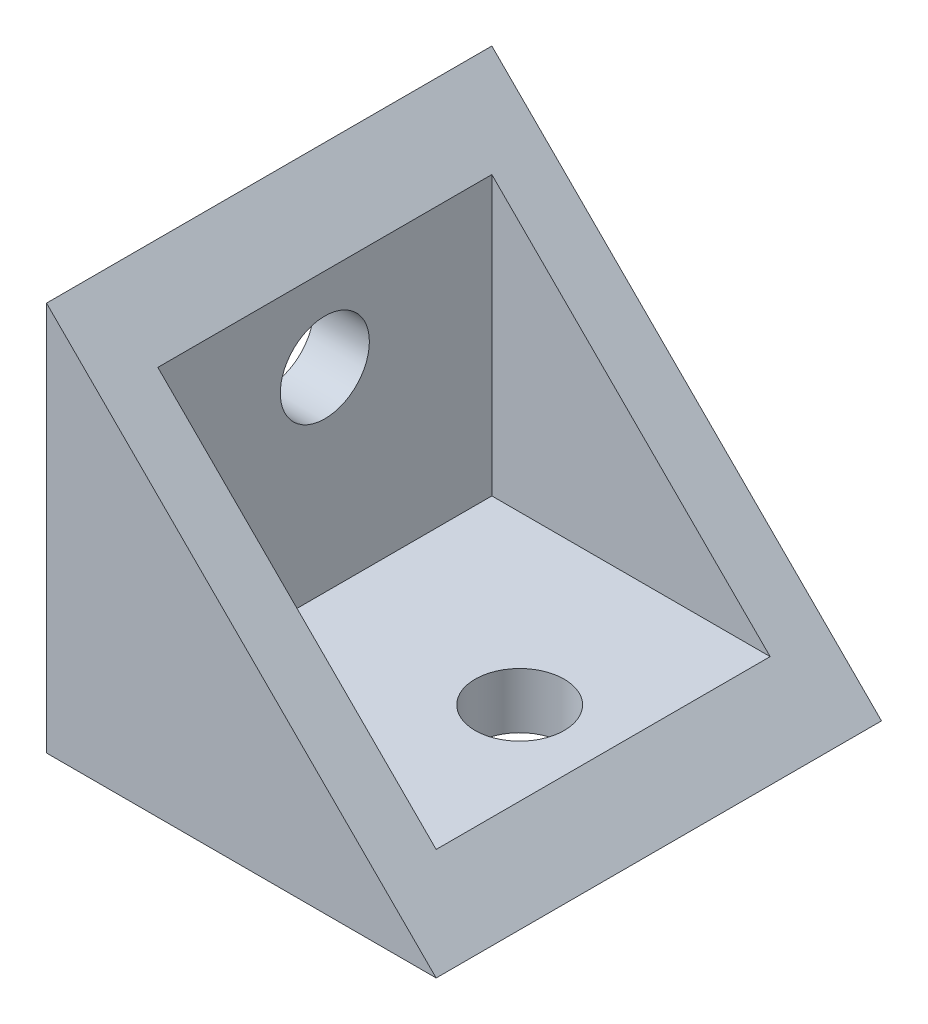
ISO-10303-21;
HEADER;
FILE_DESCRIPTION(('STEP AP214'),'2;1');
FILE_NAME('part.step','',(''),(''),'','','');
FILE_SCHEMA(('AUTOMOTIVE_DESIGN { 1 0 10303 214 1 1 1 1 }'));
ENDSEC;
DATA;
#1=APPLICATION_CONTEXT('core data for automotive mechanical design processes');
#2=APPLICATION_PROTOCOL_DEFINITION('international standard','automotive_design',2000,#1);
#3=PRODUCT_CONTEXT('',#1,'mechanical');
#4=PRODUCT('Part','Part','',(#3));
#5=PRODUCT_RELATED_PRODUCT_CATEGORY('part','',(#4));
#6=PRODUCT_DEFINITION_FORMATION('','',#4);
#7=PRODUCT_DEFINITION_CONTEXT('part definition',#1,'design');
#8=PRODUCT_DEFINITION('design','',#6,#7);
#9=PRODUCT_DEFINITION_SHAPE('','',#8);
#10=(LENGTH_UNIT() NAMED_UNIT(*) SI_UNIT(.MILLI.,.METRE.));
#11=(NAMED_UNIT(*) PLANE_ANGLE_UNIT() SI_UNIT($,.RADIAN.));
#12=(NAMED_UNIT(*) SI_UNIT($,.STERADIAN.) SOLID_ANGLE_UNIT());
#13=UNCERTAINTY_MEASURE_WITH_UNIT(LENGTH_MEASURE(1.E-05),#10,'distance_accuracy_value','');
#14=(GEOMETRIC_REPRESENTATION_CONTEXT(3) GLOBAL_UNCERTAINTY_ASSIGNED_CONTEXT((#13)) GLOBAL_UNIT_ASSIGNED_CONTEXT((#10,
#11,#12)) REPRESENTATION_CONTEXT('',''));
#15=CARTESIAN_POINT('',(0.,0.,0.));
#16=DIRECTION('',(0.,0.,1.));
#17=DIRECTION('',(1.,0.,0.));
#18=AXIS2_PLACEMENT_3D('',#15,#16,#17);
#19=CARTESIAN_POINT('',(-17.5,17.5,20.));
#20=DIRECTION('',(-0.707106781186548,-0.707106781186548,0.));
#21=DIRECTION('',(0.707106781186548,-0.707106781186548,0.));
#22=AXIS2_PLACEMENT_3D('',#19,#20,#21);
#23=PLANE('',#22);
#24=DIRECTION('',(-0.707106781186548,0.707106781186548,0.));
#25=VECTOR('',#24,1.);
#26=CARTESIAN_POINT('',(-17.5,17.5,-20.));
#27=LINE('',#26,#25);
#28=CARTESIAN_POINT('',(17.5,-17.5,-20.));
#29=VERTEX_POINT('',#28);
#30=CARTESIAN_POINT('',(-17.5,17.5,-20.));
#31=VERTEX_POINT('',#30);
#32=EDGE_CURVE('E83',#29,#31,#27,.T.);
#33=ORIENTED_EDGE('',*,*,#32,.T.);
#34=DIRECTION('',(0.,0.,-1.));
#35=VECTOR('',#34,1.);
#36=CARTESIAN_POINT('',(-17.5,17.5,20.));
#37=LINE('',#36,#35);
#38=CARTESIAN_POINT('',(-17.5,17.5,20.));
#39=VERTEX_POINT('',#38);
#40=EDGE_CURVE('E145',#39,#31,#37,.T.);
#41=ORIENTED_EDGE('',*,*,#40,.F.);
#42=DIRECTION('',(-0.707106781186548,0.707106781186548,0.));
#43=VECTOR('',#42,1.);
#44=CARTESIAN_POINT('',(-17.5,17.5,20.));
#45=LINE('',#44,#43);
#46=CARTESIAN_POINT('',(17.5,-17.5,20.));
#47=VERTEX_POINT('',#46);
#48=EDGE_CURVE('E66',#47,#39,#45,.T.);
#49=ORIENTED_EDGE('',*,*,#48,.F.);
#50=DIRECTION('',(0.,0.,-1.));
#51=VECTOR('',#50,1.);
#52=CARTESIAN_POINT('',(17.5,-17.5,20.));
#53=LINE('',#52,#51);
#54=EDGE_CURVE('E50',#47,#29,#53,.T.);
#55=ORIENTED_EDGE('',*,*,#54,.T.);
#56=EDGE_LOOP('',(#33,#41,#49,#55));
#57=FACE_BOUND('',#56,.T.);
#58=DIRECTION('',(-0.707106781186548,0.707106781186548,0.));
#59=VECTOR('',#58,1.);
#60=CARTESIAN_POINT('',(0.,0.,-15.));
#61=LINE('',#60,#59);
#62=CARTESIAN_POINT('',(12.5,-12.5,-15.));
#63=VERTEX_POINT('',#62);
#64=CARTESIAN_POINT('',(-12.5,12.5,-15.));
#65=VERTEX_POINT('',#64);
#66=EDGE_CURVE('E114',#63,#65,#61,.T.);
#67=ORIENTED_EDGE('',*,*,#66,.F.);
#68=DIRECTION('',(0.,0.,-1.));
#69=VECTOR('',#68,1.);
#70=CARTESIAN_POINT('',(12.5,-12.5,20.));
#71=LINE('',#70,#69);
#72=CARTESIAN_POINT('',(12.5,-12.5,15.));
#73=VERTEX_POINT('',#72);
#74=EDGE_CURVE('E110',#73,#63,#71,.T.);
#75=ORIENTED_EDGE('',*,*,#74,.F.);
#76=DIRECTION('',(-0.707106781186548,0.707106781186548,0.));
#77=VECTOR('',#76,1.);
#78=CARTESIAN_POINT('',(0.,0.,15.));
#79=LINE('',#78,#77);
#80=CARTESIAN_POINT('',(-12.5,12.5,15.));
#81=VERTEX_POINT('',#80);
#82=EDGE_CURVE('E57',#73,#81,#79,.T.);
#83=ORIENTED_EDGE('',*,*,#82,.T.);
#84=DIRECTION('',(0.,0.,-1.));
#85=VECTOR('',#84,1.);
#86=CARTESIAN_POINT('',(-12.5,12.5,20.));
#87=LINE('',#86,#85);
#88=EDGE_CURVE('E136',#81,#65,#87,.T.);
#89=ORIENTED_EDGE('',*,*,#88,.T.);
#90=EDGE_LOOP('',(#67,#75,#83,#89));
#91=FACE_BOUND('',#90,.T.);
#92=ADVANCED_FACE('F42',(#57,#91),#23,.F.);
#93=CARTESIAN_POINT('',(-17.5,-17.5,20.));
#94=DIRECTION('',(1.,0.,0.));
#95=DIRECTION('',(0.,0.,-1.));
#96=AXIS2_PLACEMENT_3D('',#93,#94,#95);
#97=PLANE('',#96);
#98=CARTESIAN_POINT('',(-17.5,5.,0.));
#99=DIRECTION('',(1.,0.,0.));
#100=DIRECTION('',(0.,0.,-1.));
#101=AXIS2_PLACEMENT_3D('',#98,#99,#100);
#102=CIRCLE('',#101,4.);
#103=CARTESIAN_POINT('',(-17.5,5.,-4.));
#104=VERTEX_POINT('',#103);
#105=EDGE_CURVE('E179',#104,#104,#102,.T.);
#106=ORIENTED_EDGE('',*,*,#105,.T.);
#107=EDGE_LOOP('',(#106));
#108=FACE_BOUND('',#107,.T.);
#109=DIRECTION('',(0.,-1.,0.));
#110=VECTOR('',#109,1.);
#111=CARTESIAN_POINT('',(-17.5,-17.5,-20.));
#112=LINE('',#111,#110);
#113=CARTESIAN_POINT('',(-17.5,-17.5,-20.));
#114=VERTEX_POINT('',#113);
#115=EDGE_CURVE('E123',#31,#114,#112,.T.);
#116=ORIENTED_EDGE('',*,*,#115,.T.);
#117=DIRECTION('',(0.,0.,-1.));
#118=VECTOR('',#117,1.);
#119=CARTESIAN_POINT('',(-17.5,-17.5,20.));
#120=LINE('',#119,#118);
#121=CARTESIAN_POINT('',(-17.5,-17.5,20.));
#122=VERTEX_POINT('',#121);
#123=EDGE_CURVE('E11',#122,#114,#120,.T.);
#124=ORIENTED_EDGE('',*,*,#123,.F.);
#125=DIRECTION('',(0.,-1.,0.));
#126=VECTOR('',#125,1.);
#127=CARTESIAN_POINT('',(-17.5,-17.5,20.));
#128=LINE('',#127,#126);
#129=EDGE_CURVE('E141',#39,#122,#128,.T.);
#130=ORIENTED_EDGE('',*,*,#129,.F.);
#131=ORIENTED_EDGE('',*,*,#40,.T.);
#132=EDGE_LOOP('',(#116,#124,#130,#131));
#133=FACE_BOUND('',#132,.T.);
#134=ADVANCED_FACE('F44',(#108,#133),#97,.F.);
#135=CARTESIAN_POINT('',(-17.5,-17.5,20.));
#136=DIRECTION('',(0.,1.,0.));
#137=DIRECTION('',(0.,0.,1.));
#138=AXIS2_PLACEMENT_3D('',#135,#136,#137);
#139=PLANE('',#138);
#140=CARTESIAN_POINT('',(5.,-17.5,0.));
#141=DIRECTION('',(0.,1.,0.));
#142=DIRECTION('',(0.,0.,1.));
#143=AXIS2_PLACEMENT_3D('',#140,#141,#142);
#144=CIRCLE('',#143,4.);
#145=CARTESIAN_POINT('',(5.,-17.5,4.));
#146=VERTEX_POINT('',#145);
#147=EDGE_CURVE('E126',#146,#146,#144,.T.);
#148=ORIENTED_EDGE('',*,*,#147,.T.);
#149=EDGE_LOOP('',(#148));
#150=FACE_BOUND('',#149,.T.);
#151=DIRECTION('',(1.,0.,0.));
#152=VECTOR('',#151,1.);
#153=CARTESIAN_POINT('',(-17.5,-17.5,-20.));
#154=LINE('',#153,#152);
#155=EDGE_CURVE('E148',#114,#29,#154,.T.);
#156=ORIENTED_EDGE('',*,*,#155,.T.);
#157=ORIENTED_EDGE('',*,*,#54,.F.);
#158=DIRECTION('',(1.,0.,0.));
#159=VECTOR('',#158,1.);
#160=CARTESIAN_POINT('',(-17.5,-17.5,20.));
#161=LINE('',#160,#159);
#162=EDGE_CURVE('E88',#122,#47,#161,.T.);
#163=ORIENTED_EDGE('',*,*,#162,.F.);
#164=ORIENTED_EDGE('',*,*,#123,.T.);
#165=EDGE_LOOP('',(#156,#157,#163,#164));
#166=FACE_BOUND('',#165,.T.);
#167=ADVANCED_FACE('F160',(#150,#166),#139,.F.);
#168=CARTESIAN_POINT('',(0.,0.,20.));
#169=DIRECTION('',(0.,0.,-1.));
#170=DIRECTION('',(-1.,0.,0.));
#171=AXIS2_PLACEMENT_3D('',#168,#169,#170);
#172=PLANE('',#171);
#173=ORIENTED_EDGE('',*,*,#129,.T.);
#174=ORIENTED_EDGE('',*,*,#162,.T.);
#175=ORIENTED_EDGE('',*,*,#48,.T.);
#176=EDGE_LOOP('',(#173,#174,#175));
#177=FACE_BOUND('',#176,.T.);
#178=ADVANCED_FACE('F158',(#177),#172,.F.);
#179=CARTESIAN_POINT('',(0.,0.,-20.));
#180=DIRECTION('',(0.,0.,-1.));
#181=DIRECTION('',(-1.,0.,0.));
#182=AXIS2_PLACEMENT_3D('',#179,#180,#181);
#183=PLANE('',#182);
#184=ORIENTED_EDGE('',*,*,#115,.F.);
#185=ORIENTED_EDGE('',*,*,#32,.F.);
#186=ORIENTED_EDGE('',*,*,#155,.F.);
#187=EDGE_LOOP('',(#184,#185,#186));
#188=FACE_BOUND('',#187,.T.);
#189=ADVANCED_FACE('F154',(#188),#183,.T.);
#190=CARTESIAN_POINT('',(-12.5,-17.5,20.));
#191=DIRECTION('',(1.,0.,0.));
#192=DIRECTION('',(0.,0.,-1.));
#193=AXIS2_PLACEMENT_3D('',#190,#191,#192);
#194=PLANE('',#193);
#195=CARTESIAN_POINT('',(-12.5,5.,0.));
#196=DIRECTION('',(1.,0.,0.));
#197=DIRECTION('',(0.,0.,-1.));
#198=AXIS2_PLACEMENT_3D('',#195,#196,#197);
#199=CIRCLE('',#198,4.);
#200=CARTESIAN_POINT('',(-12.5,5.,-4.));
#201=VERTEX_POINT('',#200);
#202=EDGE_CURVE('E181',#201,#201,#199,.T.);
#203=ORIENTED_EDGE('',*,*,#202,.F.);
#204=EDGE_LOOP('',(#203));
#205=FACE_BOUND('',#204,.T.);
#206=DIRECTION('',(0.,-1.,0.));
#207=VECTOR('',#206,1.);
#208=CARTESIAN_POINT('',(-12.5,0.,-15.));
#209=LINE('',#208,#207);
#210=CARTESIAN_POINT('',(-12.5,-12.5,-15.));
#211=VERTEX_POINT('',#210);
#212=EDGE_CURVE('E115',#65,#211,#209,.T.);
#213=ORIENTED_EDGE('',*,*,#212,.F.);
#214=ORIENTED_EDGE('',*,*,#88,.F.);
#215=DIRECTION('',(0.,-1.,0.));
#216=VECTOR('',#215,1.);
#217=CARTESIAN_POINT('',(-12.5,0.,15.));
#218=LINE('',#217,#216);
#219=CARTESIAN_POINT('',(-12.5,-12.5,15.));
#220=VERTEX_POINT('',#219);
#221=EDGE_CURVE('E122',#81,#220,#218,.T.);
#222=ORIENTED_EDGE('',*,*,#221,.T.);
#223=DIRECTION('',(0.,0.,-1.));
#224=VECTOR('',#223,1.);
#225=CARTESIAN_POINT('',(-12.5,-12.5,20.));
#226=LINE('',#225,#224);
#227=EDGE_CURVE('E108',#220,#211,#226,.T.);
#228=ORIENTED_EDGE('',*,*,#227,.T.);
#229=EDGE_LOOP('',(#213,#214,#222,#228));
#230=FACE_BOUND('',#229,.T.);
#231=ADVANCED_FACE('F120',(#205,#230),#194,.T.);
#232=CARTESIAN_POINT('',(-17.5,-12.5,20.));
#233=DIRECTION('',(0.,1.,0.));
#234=DIRECTION('',(0.,0.,1.));
#235=AXIS2_PLACEMENT_3D('',#232,#233,#234);
#236=PLANE('',#235);
#237=CARTESIAN_POINT('',(5.,-12.5,0.));
#238=DIRECTION('',(0.,1.,0.));
#239=DIRECTION('',(0.,0.,1.));
#240=AXIS2_PLACEMENT_3D('',#237,#238,#239);
#241=CIRCLE('',#240,4.);
#242=CARTESIAN_POINT('',(5.,-12.5,4.));
#243=VERTEX_POINT('',#242);
#244=EDGE_CURVE('E129',#243,#243,#241,.T.);
#245=ORIENTED_EDGE('',*,*,#244,.F.);
#246=EDGE_LOOP('',(#245));
#247=FACE_BOUND('',#246,.T.);
#248=DIRECTION('',(1.,0.,0.));
#249=VECTOR('',#248,1.);
#250=CARTESIAN_POINT('',(0.,-12.5,-15.));
#251=LINE('',#250,#249);
#252=EDGE_CURVE('E105',#211,#63,#251,.T.);
#253=ORIENTED_EDGE('',*,*,#252,.F.);
#254=ORIENTED_EDGE('',*,*,#227,.F.);
#255=DIRECTION('',(1.,0.,0.));
#256=VECTOR('',#255,1.);
#257=CARTESIAN_POINT('',(0.,-12.5,15.));
#258=LINE('',#257,#256);
#259=EDGE_CURVE('E133',#220,#73,#258,.T.);
#260=ORIENTED_EDGE('',*,*,#259,.T.);
#261=ORIENTED_EDGE('',*,*,#74,.T.);
#262=EDGE_LOOP('',(#253,#254,#260,#261));
#263=FACE_BOUND('',#262,.T.);
#264=ADVANCED_FACE('F107',(#247,#263),#236,.T.);
#265=CARTESIAN_POINT('',(0.,0.,15.));
#266=DIRECTION('',(0.,0.,-1.));
#267=DIRECTION('',(-1.,0.,0.));
#268=AXIS2_PLACEMENT_3D('',#265,#266,#267);
#269=PLANE('',#268);
#270=ORIENTED_EDGE('',*,*,#221,.F.);
#271=ORIENTED_EDGE('',*,*,#82,.F.);
#272=ORIENTED_EDGE('',*,*,#259,.F.);
#273=EDGE_LOOP('',(#270,#271,#272));
#274=FACE_BOUND('',#273,.T.);
#275=ADVANCED_FACE('F195',(#274),#269,.T.);
#276=CARTESIAN_POINT('',(0.,0.,-15.));
#277=DIRECTION('',(0.,0.,-1.));
#278=DIRECTION('',(-1.,0.,0.));
#279=AXIS2_PLACEMENT_3D('',#276,#277,#278);
#280=PLANE('',#279);
#281=ORIENTED_EDGE('',*,*,#212,.T.);
#282=ORIENTED_EDGE('',*,*,#252,.T.);
#283=ORIENTED_EDGE('',*,*,#66,.T.);
#284=EDGE_LOOP('',(#281,#282,#283));
#285=FACE_BOUND('',#284,.T.);
#286=ADVANCED_FACE('F125',(#285),#280,.F.);
#287=CARTESIAN_POINT('',(5.,-17.5,0.));
#288=DIRECTION('',(0.,1.,0.));
#289=DIRECTION('',(0.,0.,1.));
#290=AXIS2_PLACEMENT_3D('',#287,#288,#289);
#291=CYLINDRICAL_SURFACE('',#290,4.);
#292=ORIENTED_EDGE('',*,*,#147,.F.);
#293=EDGE_LOOP('',(#292));
#294=FACE_BOUND('',#293,.T.);
#295=ORIENTED_EDGE('',*,*,#244,.T.);
#296=EDGE_LOOP('',(#295));
#297=FACE_BOUND('',#296,.T.);
#298=ADVANCED_FACE('F199',(#294,#297),#291,.F.);
#299=CARTESIAN_POINT('',(-17.5,5.,0.));
#300=DIRECTION('',(1.,0.,0.));
#301=DIRECTION('',(0.,0.,-1.));
#302=AXIS2_PLACEMENT_3D('',#299,#300,#301);
#303=CYLINDRICAL_SURFACE('',#302,4.);
#304=ORIENTED_EDGE('',*,*,#105,.F.);
#305=EDGE_LOOP('',(#304));
#306=FACE_BOUND('',#305,.T.);
#307=ORIENTED_EDGE('',*,*,#202,.T.);
#308=EDGE_LOOP('',(#307));
#309=FACE_BOUND('',#308,.T.);
#310=ADVANCED_FACE('F188',(#306,#309),#303,.F.);
#311=CLOSED_SHELL('',(#92,#134,#167,#178,#189,#231,#264,#275,#286,#298,#310));
#312=MANIFOLD_SOLID_BREP('B2',#311);
#313=ADVANCED_BREP_SHAPE_REPRESENTATION('',(#18,#312),#14);
#314=SHAPE_DEFINITION_REPRESENTATION(#9,#313);
ENDSEC;
END-ISO-10303-21;
